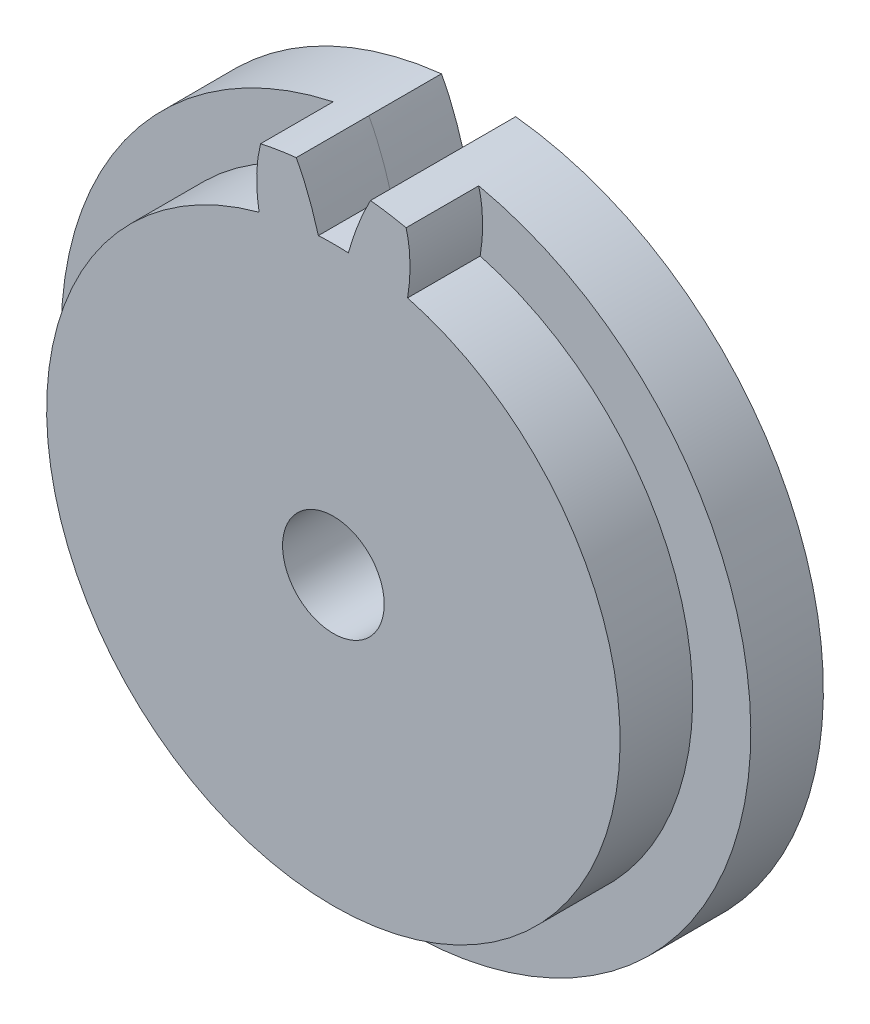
ISO-10303-21;
HEADER;
FILE_DESCRIPTION(('STEP AP214'),'2;1');
FILE_NAME('part.step','',(''),(''),'','','');
FILE_SCHEMA(('AUTOMOTIVE_DESIGN { 1 0 10303 214 1 1 1 1 }'));
ENDSEC;
DATA;
#1=APPLICATION_CONTEXT('core data for automotive mechanical design processes');
#2=APPLICATION_PROTOCOL_DEFINITION('international standard','automotive_design',2000,#1);
#3=PRODUCT_CONTEXT('',#1,'mechanical');
#4=PRODUCT('Part','Part','',(#3));
#5=PRODUCT_RELATED_PRODUCT_CATEGORY('part','',(#4));
#6=PRODUCT_DEFINITION_FORMATION('','',#4);
#7=PRODUCT_DEFINITION_CONTEXT('part definition',#1,'design');
#8=PRODUCT_DEFINITION('design','',#6,#7);
#9=PRODUCT_DEFINITION_SHAPE('','',#8);
#10=(LENGTH_UNIT() NAMED_UNIT(*) SI_UNIT(.MILLI.,.METRE.));
#11=(NAMED_UNIT(*) PLANE_ANGLE_UNIT() SI_UNIT($,.RADIAN.));
#12=(NAMED_UNIT(*) SI_UNIT($,.STERADIAN.) SOLID_ANGLE_UNIT());
#13=UNCERTAINTY_MEASURE_WITH_UNIT(LENGTH_MEASURE(1.E-05),#10,'distance_accuracy_value','');
#14=(GEOMETRIC_REPRESENTATION_CONTEXT(3) GLOBAL_UNCERTAINTY_ASSIGNED_CONTEXT((#13)) GLOBAL_UNIT_ASSIGNED_CONTEXT((#10,
#11,#12)) REPRESENTATION_CONTEXT('',''));
#15=CARTESIAN_POINT('',(0.,0.,0.));
#16=DIRECTION('',(0.,0.,1.));
#17=DIRECTION('',(1.,0.,0.));
#18=AXIS2_PLACEMENT_3D('',#15,#16,#17);
#19=CARTESIAN_POINT('',(12.1495006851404,53.7375451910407,10.));
#20=DIRECTION('',(0.,0.,1.));
#21=DIRECTION('',(1.,0.,0.));
#22=AXIS2_PLACEMENT_3D('',#19,#20,#21);
#23=PLANE('',#22);
#24=CARTESIAN_POINT('',(0.,0.,10.));
#25=DIRECTION('',(0.,0.,1.));
#26=DIRECTION('',(1.,0.,0.));
#27=AXIS2_PLACEMENT_3D('',#24,#25,#26);
#28=CIRCLE('',#27,7.);
#29=CARTESIAN_POINT('',(7.,0.,10.));
#30=VERTEX_POINT('',#29);
#31=EDGE_CURVE('E182',#30,#30,#28,.T.);
#32=ORIENTED_EDGE('',*,*,#31,.F.);
#33=EDGE_LOOP('',(#32));
#34=FACE_BOUND('',#33,.T.);
#35=CARTESIAN_POINT('',(-917633.818479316,-397396.030472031,10.));
#36=CARTESIAN_POINT('',(919840.606993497,392362.697146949,10.));
#37=CARTESIAN_POINT('',(-922010.335510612,-387134.716391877,10.));
#38=B_SPLINE_CURVE_WITH_KNOTS('',2,(#35,#36,#37),.UNSPECIFIED.,.F.,.F.,(3,3),(0.,1.),.UNSPECIFIED.);
#39=CARTESIAN_POINT('',(10.2233522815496,38.1540701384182,10.));
#40=VERTEX_POINT('',#39);
#41=CARTESIAN_POINT('',(10.023741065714,46.4303199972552,10.));
#42=VERTEX_POINT('',#41);
#43=EDGE_CURVE('E167',#40,#42,#38,.T.);
#44=ORIENTED_EDGE('',*,*,#43,.T.);
#45=CARTESIAN_POINT('',(0.,0.,10.));
#46=DIRECTION('',(0.,0.,1.));
#47=DIRECTION('',(1.,0.,0.));
#48=AXIS2_PLACEMENT_3D('',#45,#46,#47);
#49=CIRCLE('',#48,47.5);
#50=CARTESIAN_POINT('',(5.1154310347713,47.2237478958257,10.));
#51=VERTEX_POINT('',#50);
#52=EDGE_CURVE('E293',#42,#51,#49,.T.);
#53=ORIENTED_EDGE('',*,*,#52,.T.);
#54=CARTESIAN_POINT('',(285380.383929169,-958373.211537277,10.));
#55=CARTESIAN_POINT('',(-281371.053634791,959649.221586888,10.));
#56=CARTESIAN_POINT('',(277410.321343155,-960710.281455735,10.));
#57=B_SPLINE_CURVE_WITH_KNOTS('',2,(#54,#55,#56),.UNSPECIFIED.,.F.,.F.,(3,3),(0.,1.),.UNSPECIFIED.);
#58=CARTESIAN_POINT('',(2.06727027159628,39.4458666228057,10.));
#59=VERTEX_POINT('',#58);
#60=EDGE_CURVE('E208',#51,#59,#57,.T.);
#61=ORIENTED_EDGE('',*,*,#60,.T.);
#62=CARTESIAN_POINT('',(0.,0.,10.));
#63=DIRECTION('',(0.,0.,1.));
#64=DIRECTION('',(1.,0.,0.));
#65=AXIS2_PLACEMENT_3D('',#62,#63,#64);
#66=CIRCLE('',#65,39.5);
#67=CARTESIAN_POINT('',(-2.06727027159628,39.4458666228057,10.));
#68=VERTEX_POINT('',#67);
#69=EDGE_CURVE('E226',#59,#68,#66,.T.);
#70=ORIENTED_EDGE('',*,*,#69,.T.);
#71=CARTESIAN_POINT('',(-277410.321343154,-960710.281455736,10.));
#72=CARTESIAN_POINT('',(281371.053634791,959649.221586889,10.));
#73=CARTESIAN_POINT('',(-285380.383929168,-958373.211537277,10.));
#74=B_SPLINE_CURVE_WITH_KNOTS('',2,(#71,#72,#73),.UNSPECIFIED.,.F.,.F.,(3,3),(0.,1.),.UNSPECIFIED.);
#75=CARTESIAN_POINT('',(-5.11543103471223,47.2237478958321,10.));
#76=VERTEX_POINT('',#75);
#77=EDGE_CURVE('E242',#68,#76,#74,.T.);
#78=ORIENTED_EDGE('',*,*,#77,.T.);
#79=CARTESIAN_POINT('',(-10.023741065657,46.4303199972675,10.));
#80=VERTEX_POINT('',#79);
#81=EDGE_CURVE('E295',#76,#80,#49,.T.);
#82=ORIENTED_EDGE('',*,*,#81,.T.);
#83=CARTESIAN_POINT('',(922010.335510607,-387134.71639189,10.));
#84=CARTESIAN_POINT('',(-919840.606993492,392362.697146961,10.));
#85=CARTESIAN_POINT('',(917633.818479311,-397396.030472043,10.));
#86=B_SPLINE_CURVE_WITH_KNOTS('',2,(#83,#84,#85),.UNSPECIFIED.,.F.,.F.,(3,3),(0.,1.),.UNSPECIFIED.);
#87=CARTESIAN_POINT('',(-10.2233522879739,38.1540701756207,10.));
#88=VERTEX_POINT('',#87);
#89=EDGE_CURVE('E247',#80,#88,#86,.T.);
#90=ORIENTED_EDGE('',*,*,#89,.T.);
#91=CARTESIAN_POINT('',(0.,0.,10.));
#92=DIRECTION('',(0.,0.,1.));
#93=DIRECTION('',(1.,0.,0.));
#94=AXIS2_PLACEMENT_3D('',#91,#92,#93);
#95=CIRCLE('',#94,39.5);
#96=EDGE_CURVE('E56',#88,#40,#95,.T.);
#97=ORIENTED_EDGE('',*,*,#96,.T.);
#98=EDGE_LOOP('',(#44,#53,#61,#70,#78,#82,#90,#97));
#99=FACE_BOUND('',#98,.T.);
#100=ADVANCED_FACE('F33',(#34,#99),#23,.T.);
#101=DIRECTION('',(0.,0.,-1.));
#102=VECTOR('',#101,1.);
#103=SURFACE_OF_LINEAR_EXTRUSION('',#57,#102);
#104=DIRECTION('',(0.,0.,-1.));
#105=VECTOR('',#104,1.);
#106=CARTESIAN_POINT('',(5.11543103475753,47.2237478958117,10.));
#107=LINE('',#106,#105);
#108=CARTESIAN_POINT('',(5.11543103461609,47.2237478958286,0.));
#109=VERTEX_POINT('',#108);
#110=EDGE_CURVE('E123',#109,#51,#107,.F.);
#111=ORIENTED_EDGE('',*,*,#110,.F.);
#112=CARTESIAN_POINT('',(285380.383929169,-958373.211537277,0.));
#113=CARTESIAN_POINT('',(-281371.053634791,959649.221586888,0.));
#114=CARTESIAN_POINT('',(277410.321343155,-960710.281455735,0.));
#115=B_SPLINE_CURVE_WITH_KNOTS('',2,(#112,#113,#114),.UNSPECIFIED.,.F.,.F.,(3,3),(0.,1.),.UNSPECIFIED.);
#116=CARTESIAN_POINT('',(2.06727027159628,39.4458666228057,0.));
#117=VERTEX_POINT('',#116);
#118=EDGE_CURVE('E122',#109,#117,#115,.T.);
#119=ORIENTED_EDGE('',*,*,#118,.T.);
#120=DIRECTION('',(0.,0.,-1.));
#121=VECTOR('',#120,1.);
#122=CARTESIAN_POINT('',(2.06727027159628,39.4458666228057,10.));
#123=LINE('',#122,#121);
#124=EDGE_CURVE('E42',#59,#117,#123,.T.);
#125=ORIENTED_EDGE('',*,*,#124,.F.);
#126=ORIENTED_EDGE('',*,*,#60,.F.);
#127=EDGE_LOOP('',(#111,#119,#125,#126));
#128=FACE_BOUND('',#127,.T.);
#129=ADVANCED_FACE('F35',(#128),#103,.F.);
#130=DIRECTION('',(0.,0.,-1.));
#131=VECTOR('',#130,1.);
#132=SURFACE_OF_LINEAR_EXTRUSION('',#74,#131);
#133=DIRECTION('',(0.,0.,-1.));
#134=VECTOR('',#133,1.);
#135=CARTESIAN_POINT('',(-5.11543103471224,47.2237478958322,10.));
#136=LINE('',#135,#134);
#137=CARTESIAN_POINT('',(-5.11543103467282,47.2237478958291,0.));
#138=VERTEX_POINT('',#137);
#139=EDGE_CURVE('E124',#76,#138,#136,.T.);
#140=ORIENTED_EDGE('',*,*,#139,.F.);
#141=ORIENTED_EDGE('',*,*,#77,.F.);
#142=DIRECTION('',(0.,0.,-1.));
#143=VECTOR('',#142,1.);
#144=CARTESIAN_POINT('',(-2.06727027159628,39.4458666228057,10.));
#145=LINE('',#144,#143);
#146=CARTESIAN_POINT('',(-2.06727026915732,39.4458666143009,0.));
#147=VERTEX_POINT('',#146);
#148=EDGE_CURVE('E217',#68,#147,#145,.T.);
#149=ORIENTED_EDGE('',*,*,#148,.T.);
#150=CARTESIAN_POINT('',(-277410.321343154,-960710.281455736,0.));
#151=CARTESIAN_POINT('',(281371.053634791,959649.221586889,0.));
#152=CARTESIAN_POINT('',(-285380.383929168,-958373.211537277,0.));
#153=B_SPLINE_CURVE_WITH_KNOTS('',2,(#150,#151,#152),.UNSPECIFIED.,.F.,.F.,(3,3),(0.,1.),.UNSPECIFIED.);
#154=EDGE_CURVE('E181',#147,#138,#153,.T.);
#155=ORIENTED_EDGE('',*,*,#154,.T.);
#156=EDGE_LOOP('',(#140,#141,#149,#155));
#157=FACE_BOUND('',#156,.T.);
#158=ADVANCED_FACE('F255',(#157),#132,.F.);
#159=DIRECTION('',(0.,0.,-1.));
#160=VECTOR('',#159,1.);
#161=SURFACE_OF_LINEAR_EXTRUSION('',#86,#160);
#162=DIRECTION('',(0.,0.,-1.));
#163=VECTOR('',#162,1.);
#164=CARTESIAN_POINT('',(-10.0237410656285,46.4303199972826,10.));
#165=LINE('',#164,#163);
#166=CARTESIAN_POINT('',(-10.0237410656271,46.430319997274,0.));
#167=VERTEX_POINT('',#166);
#168=EDGE_CURVE('E135',#167,#80,#165,.F.);
#169=ORIENTED_EDGE('',*,*,#168,.F.);
#170=CARTESIAN_POINT('',(922010.335510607,-387134.71639189,0.));
#171=CARTESIAN_POINT('',(-919840.606993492,392362.697146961,0.));
#172=CARTESIAN_POINT('',(917633.818479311,-397396.030472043,0.));
#173=B_SPLINE_CURVE_WITH_KNOTS('',2,(#170,#171,#172),.UNSPECIFIED.,.F.,.F.,(3,3),(0.,1.),.UNSPECIFIED.);
#174=CARTESIAN_POINT('',(-10.2233522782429,38.1540701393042,0.));
#175=VERTEX_POINT('',#174);
#176=EDGE_CURVE('E190',#167,#175,#173,.T.);
#177=ORIENTED_EDGE('',*,*,#176,.T.);
#178=DIRECTION('',(0.,0.,-1.));
#179=VECTOR('',#178,1.);
#180=CARTESIAN_POINT('',(-10.2233522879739,38.1540701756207,10.));
#181=LINE('',#180,#179);
#182=EDGE_CURVE('E214',#88,#175,#181,.T.);
#183=ORIENTED_EDGE('',*,*,#182,.F.);
#184=ORIENTED_EDGE('',*,*,#89,.F.);
#185=EDGE_LOOP('',(#169,#177,#183,#184));
#186=FACE_BOUND('',#185,.T.);
#187=ADVANCED_FACE('F164',(#186),#161,.F.);
#188=DIRECTION('',(0.,0.,-1.));
#189=VECTOR('',#188,1.);
#190=SURFACE_OF_LINEAR_EXTRUSION('',#38,#189);
#191=DIRECTION('',(0.,0.,-1.));
#192=VECTOR('',#191,1.);
#193=CARTESIAN_POINT('',(10.0237410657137,46.4303199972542,10.));
#194=LINE('',#193,#192);
#195=CARTESIAN_POINT('',(10.0237410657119,46.4303199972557,0.));
#196=VERTEX_POINT('',#195);
#197=EDGE_CURVE('E280',#42,#196,#194,.T.);
#198=ORIENTED_EDGE('',*,*,#197,.F.);
#199=ORIENTED_EDGE('',*,*,#43,.F.);
#200=DIRECTION('',(0.,0.,-1.));
#201=VECTOR('',#200,1.);
#202=CARTESIAN_POINT('',(10.2233522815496,38.1540701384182,10.));
#203=LINE('',#202,#201);
#204=CARTESIAN_POINT('',(10.2233522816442,38.1540701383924,0.));
#205=VERTEX_POINT('',#204);
#206=EDGE_CURVE('E173',#40,#205,#203,.T.);
#207=ORIENTED_EDGE('',*,*,#206,.T.);
#208=CARTESIAN_POINT('',(-917633.818479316,-397396.030472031,0.));
#209=CARTESIAN_POINT('',(919840.606993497,392362.697146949,0.));
#210=CARTESIAN_POINT('',(-922010.335510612,-387134.716391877,0.));
#211=B_SPLINE_CURVE_WITH_KNOTS('',2,(#208,#209,#210),.UNSPECIFIED.,.F.,.F.,(3,3),(0.,1.),.UNSPECIFIED.);
#212=EDGE_CURVE('E203',#205,#196,#211,.T.);
#213=ORIENTED_EDGE('',*,*,#212,.T.);
#214=EDGE_LOOP('',(#198,#199,#207,#213));
#215=FACE_BOUND('',#214,.T.);
#216=ADVANCED_FACE('F160',(#215),#190,.F.);
#217=CARTESIAN_POINT('',(12.1495006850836,53.7375451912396,0.));
#218=DIRECTION('',(0.,0.,-1.));
#219=DIRECTION('',(-1.,0.,0.));
#220=AXIS2_PLACEMENT_3D('',#217,#218,#219);
#221=PLANE('',#220);
#222=CARTESIAN_POINT('',(0.,0.,0.));
#223=DIRECTION('',(0.,0.,-1.));
#224=DIRECTION('',(-1.,0.,0.));
#225=AXIS2_PLACEMENT_3D('',#222,#223,#224);
#226=CIRCLE('',#225,47.5);
#227=EDGE_CURVE('E277',#196,#167,#226,.T.);
#228=ORIENTED_EDGE('',*,*,#227,.F.);
#229=ORIENTED_EDGE('',*,*,#212,.F.);
#230=CARTESIAN_POINT('',(0.,0.,0.));
#231=DIRECTION('',(0.,0.,1.));
#232=DIRECTION('',(1.,0.,0.));
#233=AXIS2_PLACEMENT_3D('',#230,#231,#232);
#234=CIRCLE('',#233,39.5);
#235=EDGE_CURVE('E197',#175,#205,#234,.T.);
#236=ORIENTED_EDGE('',*,*,#235,.F.);
#237=ORIENTED_EDGE('',*,*,#176,.F.);
#238=EDGE_LOOP('',(#228,#229,#236,#237));
#239=FACE_BOUND('',#238,.T.);
#240=ADVANCED_FACE('F150',(#239),#221,.F.);
#241=CARTESIAN_POINT('',(285380.383929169,-958373.211537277,-10.));
#242=CARTESIAN_POINT('',(-281371.053634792,959649.221586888,-10.));
#243=CARTESIAN_POINT('',(277410.321343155,-960710.281455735,-10.));
#244=B_SPLINE_CURVE_WITH_KNOTS('',2,(#241,#242,#243),.UNSPECIFIED.,.F.,.F.,(3,3),(0.,1.),.UNSPECIFIED.);
#245=DIRECTION('',(0.,0.,1.));
#246=VECTOR('',#245,1.);
#247=SURFACE_OF_LINEAR_EXTRUSION('',#244,#246);
#248=ORIENTED_EDGE('',*,*,#118,.F.);
#249=DIRECTION('',(0.,0.,1.));
#250=VECTOR('',#249,1.);
#251=CARTESIAN_POINT('',(5.11543103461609,47.2237478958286,-10.));
#252=LINE('',#251,#250);
#253=CARTESIAN_POINT('',(5.11543103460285,47.2237478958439,-10.));
#254=VERTEX_POINT('',#253);
#255=EDGE_CURVE('E110',#109,#254,#252,.F.);
#256=ORIENTED_EDGE('',*,*,#255,.T.);
#257=CARTESIAN_POINT('',(2.06727027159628,39.4458666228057,-10.));
#258=VERTEX_POINT('',#257);
#259=EDGE_CURVE('E120',#254,#258,#244,.T.);
#260=ORIENTED_EDGE('',*,*,#259,.T.);
#261=DIRECTION('',(0.,0.,1.));
#262=VECTOR('',#261,1.);
#263=CARTESIAN_POINT('',(2.06727027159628,39.4458666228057,-10.));
#264=LINE('',#263,#262);
#265=EDGE_CURVE('E224',#258,#117,#264,.T.);
#266=ORIENTED_EDGE('',*,*,#265,.T.);
#267=EDGE_LOOP('',(#248,#256,#260,#266));
#268=FACE_BOUND('',#267,.T.);
#269=ADVANCED_FACE('F118',(#268),#247,.T.);
#270=CARTESIAN_POINT('',(-277410.32134314,-960710.28145574,-10.));
#271=CARTESIAN_POINT('',(281371.053634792,959649.221586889,-10.));
#272=CARTESIAN_POINT('',(-285380.383929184,-958373.211537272,-10.));
#273=B_SPLINE_CURVE_WITH_KNOTS('',2,(#270,#271,#272),.UNSPECIFIED.,.F.,.F.,(3,3),(0.,1.),.UNSPECIFIED.);
#274=DIRECTION('',(0.,0.,1.));
#275=VECTOR('',#274,1.);
#276=SURFACE_OF_LINEAR_EXTRUSION('',#273,#275);
#277=CARTESIAN_POINT('',(-2.06727026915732,39.4458666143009,-10.));
#278=VERTEX_POINT('',#277);
#279=CARTESIAN_POINT('',(-5.1154310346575,47.223747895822,-10.));
#280=VERTEX_POINT('',#279);
#281=EDGE_CURVE('E132',#278,#280,#273,.T.);
#282=ORIENTED_EDGE('',*,*,#281,.T.);
#283=DIRECTION('',(0.,0.,1.));
#284=VECTOR('',#283,1.);
#285=CARTESIAN_POINT('',(-5.11543103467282,47.2237478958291,-10.));
#286=LINE('',#285,#284);
#287=EDGE_CURVE('E49',#280,#138,#286,.T.);
#288=ORIENTED_EDGE('',*,*,#287,.T.);
#289=ORIENTED_EDGE('',*,*,#154,.F.);
#290=DIRECTION('',(0.,0.,1.));
#291=VECTOR('',#290,1.);
#292=CARTESIAN_POINT('',(-2.06727026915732,39.4458666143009,-10.));
#293=LINE('',#292,#291);
#294=EDGE_CURVE('E229',#278,#147,#293,.T.);
#295=ORIENTED_EDGE('',*,*,#294,.F.);
#296=EDGE_LOOP('',(#282,#288,#289,#295));
#297=FACE_BOUND('',#296,.T.);
#298=ADVANCED_FACE('F149',(#297),#276,.T.);
#299=CARTESIAN_POINT('',(12.1495006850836,53.7375451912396,-10.));
#300=DIRECTION('',(0.,0.,-1.));
#301=DIRECTION('',(-1.,0.,0.));
#302=AXIS2_PLACEMENT_3D('',#299,#300,#301);
#303=PLANE('',#302);
#304=CARTESIAN_POINT('',(0.,0.,-10.));
#305=DIRECTION('',(0.,0.,1.));
#306=DIRECTION('',(1.,0.,0.));
#307=AXIS2_PLACEMENT_3D('',#304,#305,#306);
#308=CIRCLE('',#307,7.);
#309=CARTESIAN_POINT('',(7.,0.,-10.));
#310=VERTEX_POINT('',#309);
#311=EDGE_CURVE('E130',#310,#310,#308,.T.);
#312=ORIENTED_EDGE('',*,*,#311,.T.);
#313=EDGE_LOOP('',(#312));
#314=FACE_BOUND('',#313,.T.);
#315=ORIENTED_EDGE('',*,*,#259,.F.);
#316=CARTESIAN_POINT('',(0.,0.,-10.));
#317=DIRECTION('',(0.,0.,-1.));
#318=DIRECTION('',(-1.,0.,0.));
#319=AXIS2_PLACEMENT_3D('',#316,#317,#318);
#320=CIRCLE('',#319,47.5);
#321=EDGE_CURVE('E11',#254,#280,#320,.T.);
#322=ORIENTED_EDGE('',*,*,#321,.T.);
#323=ORIENTED_EDGE('',*,*,#281,.F.);
#324=CARTESIAN_POINT('',(0.,0.,-10.));
#325=DIRECTION('',(0.,0.,1.));
#326=DIRECTION('',(1.,0.,0.));
#327=AXIS2_PLACEMENT_3D('',#324,#325,#326);
#328=CIRCLE('',#327,39.5);
#329=EDGE_CURVE('E129',#258,#278,#328,.T.);
#330=ORIENTED_EDGE('',*,*,#329,.F.);
#331=EDGE_LOOP('',(#315,#322,#323,#330));
#332=FACE_BOUND('',#331,.T.);
#333=ADVANCED_FACE('F127',(#314,#332),#303,.T.);
#334=CARTESIAN_POINT('',(0.,0.,10.));
#335=DIRECTION('',(0.,0.,-1.));
#336=DIRECTION('',(-1.,0.,0.));
#337=AXIS2_PLACEMENT_3D('',#334,#335,#336);
#338=CYLINDRICAL_SURFACE('',#337,39.5);
#339=ORIENTED_EDGE('',*,*,#124,.T.);
#340=ORIENTED_EDGE('',*,*,#265,.F.);
#341=ORIENTED_EDGE('',*,*,#329,.T.);
#342=ORIENTED_EDGE('',*,*,#294,.T.);
#343=ORIENTED_EDGE('',*,*,#148,.F.);
#344=ORIENTED_EDGE('',*,*,#69,.F.);
#345=EDGE_LOOP('',(#339,#340,#341,#342,#343,#344));
#346=FACE_BOUND('',#345,.T.);
#347=ADVANCED_FACE('F223',(#346),#338,.T.);
#348=CARTESIAN_POINT('',(0.,0.,10.));
#349=DIRECTION('',(0.,0.,-1.));
#350=DIRECTION('',(-1.,0.,0.));
#351=AXIS2_PLACEMENT_3D('',#348,#349,#350);
#352=CYLINDRICAL_SURFACE('',#351,39.5);
#353=ORIENTED_EDGE('',*,*,#235,.T.);
#354=ORIENTED_EDGE('',*,*,#206,.F.);
#355=ORIENTED_EDGE('',*,*,#96,.F.);
#356=ORIENTED_EDGE('',*,*,#182,.T.);
#357=EDGE_LOOP('',(#353,#354,#355,#356));
#358=FACE_BOUND('',#357,.T.);
#359=ADVANCED_FACE('F155',(#358),#352,.T.);
#360=CARTESIAN_POINT('',(0.,0.,10.));
#361=DIRECTION('',(0.,0.,-1.));
#362=DIRECTION('',(-1.,0.,0.));
#363=AXIS2_PLACEMENT_3D('',#360,#361,#362);
#364=CYLINDRICAL_SURFACE('',#363,7.);
#365=ORIENTED_EDGE('',*,*,#31,.T.);
#366=EDGE_LOOP('',(#365));
#367=FACE_BOUND('',#366,.T.);
#368=ORIENTED_EDGE('',*,*,#311,.F.);
#369=EDGE_LOOP('',(#368));
#370=FACE_BOUND('',#369,.T.);
#371=ADVANCED_FACE('F152',(#367,#370),#364,.F.);
#372=CARTESIAN_POINT('',(0.,0.,-10.));
#373=DIRECTION('',(0.,0.,1.));
#374=DIRECTION('',(1.,0.,0.));
#375=AXIS2_PLACEMENT_3D('',#372,#373,#374);
#376=CYLINDRICAL_SURFACE('',#375,47.5);
#377=ORIENTED_EDGE('',*,*,#168,.T.);
#378=ORIENTED_EDGE('',*,*,#81,.F.);
#379=ORIENTED_EDGE('',*,*,#139,.T.);
#380=ORIENTED_EDGE('',*,*,#287,.F.);
#381=ORIENTED_EDGE('',*,*,#321,.F.);
#382=ORIENTED_EDGE('',*,*,#255,.F.);
#383=ORIENTED_EDGE('',*,*,#110,.T.);
#384=ORIENTED_EDGE('',*,*,#52,.F.);
#385=ORIENTED_EDGE('',*,*,#197,.T.);
#386=ORIENTED_EDGE('',*,*,#227,.T.);
#387=EDGE_LOOP('',(#377,#378,#379,#380,#381,#382,#383,#384,#385,#386));
#388=FACE_BOUND('',#387,.T.);
#389=ADVANCED_FACE('F109',(#388),#376,.T.);
#390=CLOSED_SHELL('',(#100,#129,#158,#187,#216,#240,#269,#298,#333,#347,#359,#371,#389));
#391=MANIFOLD_SOLID_BREP('B2',#390);
#392=ADVANCED_BREP_SHAPE_REPRESENTATION('',(#18,#391),#14);
#393=SHAPE_DEFINITION_REPRESENTATION(#9,#392);
ENDSEC;
END-ISO-10303-21;
